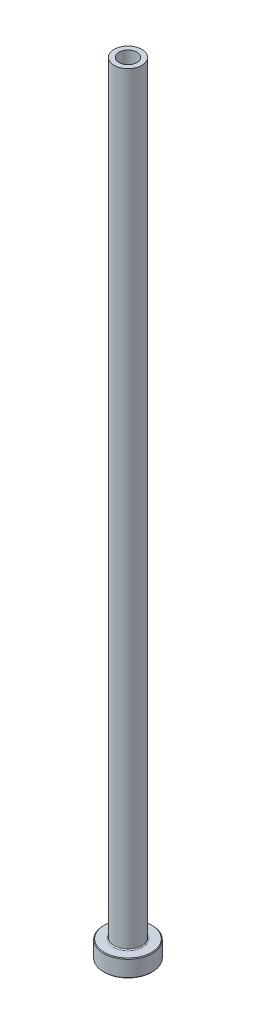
from build123d import *

# Parameters (mm, degrees)
FILLET1_R     = 0.3
CHAMFER1_SIZE = 0.2
CHAMFER3_SIZE = 0.5


with BuildPart() as part:
    # Sketch1 → Revolve1 (revolve)
    with BuildSketch(Plane.XY, mode=Mode.PRIVATE) as revolve1_sk:
        Polygon((-2.6, 225), (-4, 225), (-4, 5), (-7, 5), (-7, 0), (-2.85, 0), (-2.85, 168), (-2.6, 180), align=None)
    revolve(revolve1_sk.sketch.rotate(Axis((0, 92.187680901, 0), (0, -1, 0)), 270), axis=Axis((0, 92.187680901, 0), (0, -1, 0)))

    # Fillet1
    fillet1_edges = [part.edges().sort_by_distance(p)[0] for p in [
        (0, 5, -4),
    ]]
    fillet(fillet1_edges, radius=FILLET1_R)

    # Chamfer1
    chamfer1_edges = [part.edges().sort_by_distance(p)[0] for p in [
        (0, 0, -7),
        (0, 5, -7),
    ]]
    chamfer(chamfer1_edges, length=CHAMFER1_SIZE)

    # Chamfer3
    chamfer3_edges = [part.edges().sort_by_distance(p)[0] for p in [
        (0, 0, -2.85),
    ]]
    chamfer(chamfer3_edges, length=CHAMFER3_SIZE)


solid = part.part
